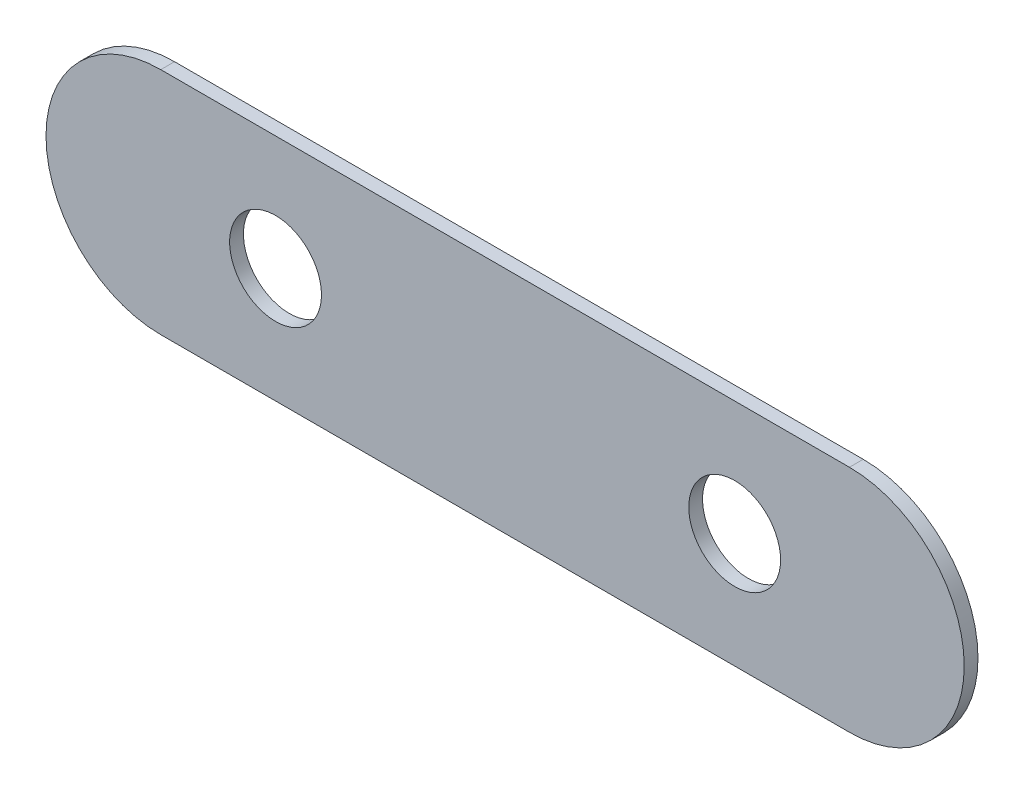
ISO-10303-21;
HEADER;
FILE_DESCRIPTION(('STEP AP214'),'2;1');
FILE_NAME('part.step','',(''),(''),'','','');
FILE_SCHEMA(('AUTOMOTIVE_DESIGN { 1 0 10303 214 1 1 1 1 }'));
ENDSEC;
DATA;
#1=APPLICATION_CONTEXT('core data for automotive mechanical design processes');
#2=APPLICATION_PROTOCOL_DEFINITION('international standard','automotive_design',2000,#1);
#3=PRODUCT_CONTEXT('',#1,'mechanical');
#4=PRODUCT('Part','Part','',(#3));
#5=PRODUCT_RELATED_PRODUCT_CATEGORY('part','',(#4));
#6=PRODUCT_DEFINITION_FORMATION('','',#4);
#7=PRODUCT_DEFINITION_CONTEXT('part definition',#1,'design');
#8=PRODUCT_DEFINITION('design','',#6,#7);
#9=PRODUCT_DEFINITION_SHAPE('','',#8);
#10=(LENGTH_UNIT() NAMED_UNIT(*) SI_UNIT(.MILLI.,.METRE.));
#11=(NAMED_UNIT(*) PLANE_ANGLE_UNIT() SI_UNIT($,.RADIAN.));
#12=(NAMED_UNIT(*) SI_UNIT($,.STERADIAN.) SOLID_ANGLE_UNIT());
#13=UNCERTAINTY_MEASURE_WITH_UNIT(LENGTH_MEASURE(1.E-05),#10,'distance_accuracy_value','');
#14=(GEOMETRIC_REPRESENTATION_CONTEXT(3) GLOBAL_UNCERTAINTY_ASSIGNED_CONTEXT((#13)) GLOBAL_UNIT_ASSIGNED_CONTEXT((#10,
#11,#12)) REPRESENTATION_CONTEXT('',''));
#15=CARTESIAN_POINT('',(0.,0.,0.));
#16=DIRECTION('',(0.,0.,1.));
#17=DIRECTION('',(1.,0.,0.));
#18=AXIS2_PLACEMENT_3D('',#15,#16,#17);
#19=CARTESIAN_POINT('',(-27.2884483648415,10.1569098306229,0.3));
#20=DIRECTION('',(0.,1.,0.));
#21=DIRECTION('',(0.,0.,1.));
#22=AXIS2_PLACEMENT_3D('',#19,#20,#21);
#23=PLANE('',#22);
#24=DIRECTION('',(1.,0.,0.));
#25=VECTOR('',#24,1.);
#26=CARTESIAN_POINT('',(-27.2884483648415,10.1569098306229,0.));
#27=LINE('',#26,#25);
#28=CARTESIAN_POINT('',(-34.7884483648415,10.1569098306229,0.));
#29=VERTEX_POINT('',#28);
#30=CARTESIAN_POINT('',(-19.7884483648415,10.1569098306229,0.));
#31=VERTEX_POINT('',#30);
#32=EDGE_CURVE('E109',#29,#31,#27,.T.);
#33=ORIENTED_EDGE('',*,*,#32,.F.);
#34=DIRECTION('',(0.,0.,-1.));
#35=VECTOR('',#34,1.);
#36=CARTESIAN_POINT('',(-34.7884483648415,10.1569098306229,0.3));
#37=LINE('',#36,#35);
#38=CARTESIAN_POINT('',(-34.7884483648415,10.1569098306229,0.3));
#39=VERTEX_POINT('',#38);
#40=EDGE_CURVE('E11',#39,#29,#37,.T.);
#41=ORIENTED_EDGE('',*,*,#40,.F.);
#42=DIRECTION('',(1.,0.,0.));
#43=VECTOR('',#42,1.);
#44=CARTESIAN_POINT('',(-27.2884483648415,10.1569098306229,0.3));
#45=LINE('',#44,#43);
#46=CARTESIAN_POINT('',(-19.7884483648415,10.1569098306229,0.3));
#47=VERTEX_POINT('',#46);
#48=EDGE_CURVE('E91',#39,#47,#45,.T.);
#49=ORIENTED_EDGE('',*,*,#48,.T.);
#50=DIRECTION('',(0.,0.,-1.));
#51=VECTOR('',#50,1.);
#52=CARTESIAN_POINT('',(-19.7884483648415,10.1569098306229,0.3));
#53=LINE('',#52,#51);
#54=EDGE_CURVE('E72',#47,#31,#53,.T.);
#55=ORIENTED_EDGE('',*,*,#54,.T.);
#56=EDGE_LOOP('',(#33,#41,#49,#55));
#57=FACE_BOUND('',#56,.T.);
#58=ADVANCED_FACE('F33',(#57),#23,.T.);
#59=CARTESIAN_POINT('',(-34.7884483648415,7.65690983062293,0.3));
#60=DIRECTION('',(0.,0.,-1.));
#61=DIRECTION('',(-1.,0.,0.));
#62=AXIS2_PLACEMENT_3D('',#59,#60,#61);
#63=CYLINDRICAL_SURFACE('',#62,2.5);
#64=CARTESIAN_POINT('',(-34.7884483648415,7.65690983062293,0.));
#65=DIRECTION('',(0.,0.,1.));
#66=DIRECTION('',(1.,0.,0.));
#67=AXIS2_PLACEMENT_3D('',#64,#65,#66);
#68=CIRCLE('',#67,2.5);
#69=CARTESIAN_POINT('',(-34.7884483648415,5.15690983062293,0.));
#70=VERTEX_POINT('',#69);
#71=EDGE_CURVE('E96',#29,#70,#68,.T.);
#72=ORIENTED_EDGE('',*,*,#71,.T.);
#73=DIRECTION('',(0.,0.,-1.));
#74=VECTOR('',#73,1.);
#75=CARTESIAN_POINT('',(-34.7884483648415,5.15690983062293,0.3));
#76=LINE('',#75,#74);
#77=CARTESIAN_POINT('',(-34.7884483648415,5.15690983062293,0.3));
#78=VERTEX_POINT('',#77);
#79=EDGE_CURVE('E42',#78,#70,#76,.T.);
#80=ORIENTED_EDGE('',*,*,#79,.F.);
#81=CARTESIAN_POINT('',(-34.7884483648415,7.65690983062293,0.3));
#82=DIRECTION('',(0.,0.,1.));
#83=DIRECTION('',(1.,0.,0.));
#84=AXIS2_PLACEMENT_3D('',#81,#82,#83);
#85=CIRCLE('',#84,2.5);
#86=EDGE_CURVE('E87',#39,#78,#85,.T.);
#87=ORIENTED_EDGE('',*,*,#86,.F.);
#88=ORIENTED_EDGE('',*,*,#40,.T.);
#89=EDGE_LOOP('',(#72,#80,#87,#88));
#90=FACE_BOUND('',#89,.T.);
#91=ADVANCED_FACE('F94',(#90),#63,.T.);
#92=CARTESIAN_POINT('',(-27.2884483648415,5.15690983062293,0.3));
#93=DIRECTION('',(0.,1.,0.));
#94=DIRECTION('',(0.,0.,1.));
#95=AXIS2_PLACEMENT_3D('',#92,#93,#94);
#96=PLANE('',#95);
#97=DIRECTION('',(1.,0.,0.));
#98=VECTOR('',#97,1.);
#99=CARTESIAN_POINT('',(-27.2884483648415,5.15690983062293,0.));
#100=LINE('',#99,#98);
#101=CARTESIAN_POINT('',(-19.7884483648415,5.15690983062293,0.));
#102=VERTEX_POINT('',#101);
#103=EDGE_CURVE('E106',#70,#102,#100,.T.);
#104=ORIENTED_EDGE('',*,*,#103,.T.);
#105=DIRECTION('',(0.,0.,-1.));
#106=VECTOR('',#105,1.);
#107=CARTESIAN_POINT('',(-19.7884483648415,5.15690983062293,0.3));
#108=LINE('',#107,#106);
#109=CARTESIAN_POINT('',(-19.7884483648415,5.15690983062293,0.3));
#110=VERTEX_POINT('',#109);
#111=EDGE_CURVE('E86',#110,#102,#108,.T.);
#112=ORIENTED_EDGE('',*,*,#111,.F.);
#113=DIRECTION('',(1.,0.,0.));
#114=VECTOR('',#113,1.);
#115=CARTESIAN_POINT('',(-27.2884483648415,5.15690983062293,0.3));
#116=LINE('',#115,#114);
#117=EDGE_CURVE('E80',#78,#110,#116,.T.);
#118=ORIENTED_EDGE('',*,*,#117,.F.);
#119=ORIENTED_EDGE('',*,*,#79,.T.);
#120=EDGE_LOOP('',(#104,#112,#118,#119));
#121=FACE_BOUND('',#120,.T.);
#122=ADVANCED_FACE('F83',(#121),#96,.F.);
#123=CARTESIAN_POINT('',(-19.7884483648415,7.65690983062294,0.3));
#124=DIRECTION('',(0.,0.,-1.));
#125=DIRECTION('',(-1.,0.,0.));
#126=AXIS2_PLACEMENT_3D('',#123,#124,#125);
#127=CYLINDRICAL_SURFACE('',#126,2.5);
#128=CARTESIAN_POINT('',(-19.7884483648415,7.65690983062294,0.));
#129=DIRECTION('',(0.,0.,1.));
#130=DIRECTION('',(1.,0.,0.));
#131=AXIS2_PLACEMENT_3D('',#128,#129,#130);
#132=CIRCLE('',#131,2.5);
#133=EDGE_CURVE('E65',#102,#31,#132,.T.);
#134=ORIENTED_EDGE('',*,*,#133,.T.);
#135=ORIENTED_EDGE('',*,*,#54,.F.);
#136=CARTESIAN_POINT('',(-19.7884483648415,7.65690983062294,0.3));
#137=DIRECTION('',(0.,0.,1.));
#138=DIRECTION('',(1.,0.,0.));
#139=AXIS2_PLACEMENT_3D('',#136,#137,#138);
#140=CIRCLE('',#139,2.5);
#141=EDGE_CURVE('E50',#110,#47,#140,.T.);
#142=ORIENTED_EDGE('',*,*,#141,.F.);
#143=ORIENTED_EDGE('',*,*,#111,.T.);
#144=EDGE_LOOP('',(#134,#135,#142,#143));
#145=FACE_BOUND('',#144,.T.);
#146=ADVANCED_FACE('F143',(#145),#127,.T.);
#147=CARTESIAN_POINT('',(-22.2884483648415,7.65690983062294,0.3));
#148=DIRECTION('',(0.,0.,-1.));
#149=DIRECTION('',(-1.,0.,0.));
#150=AXIS2_PLACEMENT_3D('',#147,#148,#149);
#151=CYLINDRICAL_SURFACE('',#150,1.);
#152=CARTESIAN_POINT('',(-22.2884483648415,7.65690983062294,0.3));
#153=DIRECTION('',(0.,0.,1.));
#154=DIRECTION('',(1.,0.,0.));
#155=AXIS2_PLACEMENT_3D('',#152,#153,#154);
#156=CIRCLE('',#155,1.);
#157=CARTESIAN_POINT('',(-21.2884483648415,7.65690983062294,0.3));
#158=VERTEX_POINT('',#157);
#159=EDGE_CURVE('E104',#158,#158,#156,.T.);
#160=ORIENTED_EDGE('',*,*,#159,.T.);
#161=EDGE_LOOP('',(#160));
#162=FACE_BOUND('',#161,.T.);
#163=CARTESIAN_POINT('',(-22.2884483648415,7.65690983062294,0.));
#164=DIRECTION('',(0.,0.,1.));
#165=DIRECTION('',(1.,0.,0.));
#166=AXIS2_PLACEMENT_3D('',#163,#164,#165);
#167=CIRCLE('',#166,1.);
#168=CARTESIAN_POINT('',(-21.2884483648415,7.65690983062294,0.));
#169=VERTEX_POINT('',#168);
#170=EDGE_CURVE('E111',#169,#169,#167,.T.);
#171=ORIENTED_EDGE('',*,*,#170,.F.);
#172=EDGE_LOOP('',(#171));
#173=FACE_BOUND('',#172,.T.);
#174=ADVANCED_FACE('F35',(#162,#173),#151,.F.);
#175=CARTESIAN_POINT('',(-32.2884483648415,7.65690983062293,0.3));
#176=DIRECTION('',(0.,0.,-1.));
#177=DIRECTION('',(-1.,0.,0.));
#178=AXIS2_PLACEMENT_3D('',#175,#176,#177);
#179=CYLINDRICAL_SURFACE('',#178,0.999999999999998);
#180=CARTESIAN_POINT('',(-32.2884483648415,7.65690983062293,0.3));
#181=DIRECTION('',(0.,0.,1.));
#182=DIRECTION('',(1.,0.,0.));
#183=AXIS2_PLACEMENT_3D('',#180,#181,#182);
#184=CIRCLE('',#183,0.999999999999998);
#185=CARTESIAN_POINT('',(-31.2884483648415,7.65690983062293,0.3));
#186=VERTEX_POINT('',#185);
#187=EDGE_CURVE('E100',#186,#186,#184,.T.);
#188=ORIENTED_EDGE('',*,*,#187,.T.);
#189=EDGE_LOOP('',(#188));
#190=FACE_BOUND('',#189,.T.);
#191=CARTESIAN_POINT('',(-32.2884483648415,7.65690983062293,0.));
#192=DIRECTION('',(0.,0.,1.));
#193=DIRECTION('',(1.,0.,0.));
#194=AXIS2_PLACEMENT_3D('',#191,#192,#193);
#195=CIRCLE('',#194,0.999999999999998);
#196=CARTESIAN_POINT('',(-31.2884483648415,7.65690983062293,0.));
#197=VERTEX_POINT('',#196);
#198=EDGE_CURVE('E101',#197,#197,#195,.T.);
#199=ORIENTED_EDGE('',*,*,#198,.F.);
#200=EDGE_LOOP('',(#199));
#201=FACE_BOUND('',#200,.T.);
#202=ADVANCED_FACE('F125',(#190,#201),#179,.F.);
#203=CARTESIAN_POINT('',(-27.2884483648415,-8.51962923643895,0.3));
#204=DIRECTION('',(0.,0.,1.));
#205=DIRECTION('',(1.,0.,0.));
#206=AXIS2_PLACEMENT_3D('',#203,#204,#205);
#207=PLANE('',#206);
#208=ORIENTED_EDGE('',*,*,#159,.F.);
#209=EDGE_LOOP('',(#208));
#210=FACE_BOUND('',#209,.T.);
#211=ORIENTED_EDGE('',*,*,#48,.F.);
#212=ORIENTED_EDGE('',*,*,#86,.T.);
#213=ORIENTED_EDGE('',*,*,#117,.T.);
#214=ORIENTED_EDGE('',*,*,#141,.T.);
#215=EDGE_LOOP('',(#211,#212,#213,#214));
#216=FACE_BOUND('',#215,.T.);
#217=ORIENTED_EDGE('',*,*,#187,.F.);
#218=EDGE_LOOP('',(#217));
#219=FACE_BOUND('',#218,.T.);
#220=ADVANCED_FACE('F89',(#210,#216,#219),#207,.T.);
#221=CARTESIAN_POINT('',(-27.2884483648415,-8.51962923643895,0.));
#222=DIRECTION('',(0.,0.,1.));
#223=DIRECTION('',(1.,0.,0.));
#224=AXIS2_PLACEMENT_3D('',#221,#222,#223);
#225=PLANE('',#224);
#226=ORIENTED_EDGE('',*,*,#170,.T.);
#227=EDGE_LOOP('',(#226));
#228=FACE_BOUND('',#227,.T.);
#229=ORIENTED_EDGE('',*,*,#32,.T.);
#230=ORIENTED_EDGE('',*,*,#133,.F.);
#231=ORIENTED_EDGE('',*,*,#103,.F.);
#232=ORIENTED_EDGE('',*,*,#71,.F.);
#233=EDGE_LOOP('',(#229,#230,#231,#232));
#234=FACE_BOUND('',#233,.T.);
#235=ORIENTED_EDGE('',*,*,#198,.T.);
#236=EDGE_LOOP('',(#235));
#237=FACE_BOUND('',#236,.T.);
#238=ADVANCED_FACE('F124',(#228,#234,#237),#225,.F.);
#239=CLOSED_SHELL('',(#58,#91,#122,#146,#174,#202,#220,#238));
#240=MANIFOLD_SOLID_BREP('B2',#239);
#241=ADVANCED_BREP_SHAPE_REPRESENTATION('',(#18,#240),#14);
#242=SHAPE_DEFINITION_REPRESENTATION(#9,#241);
ENDSEC;
END-ISO-10303-21;
